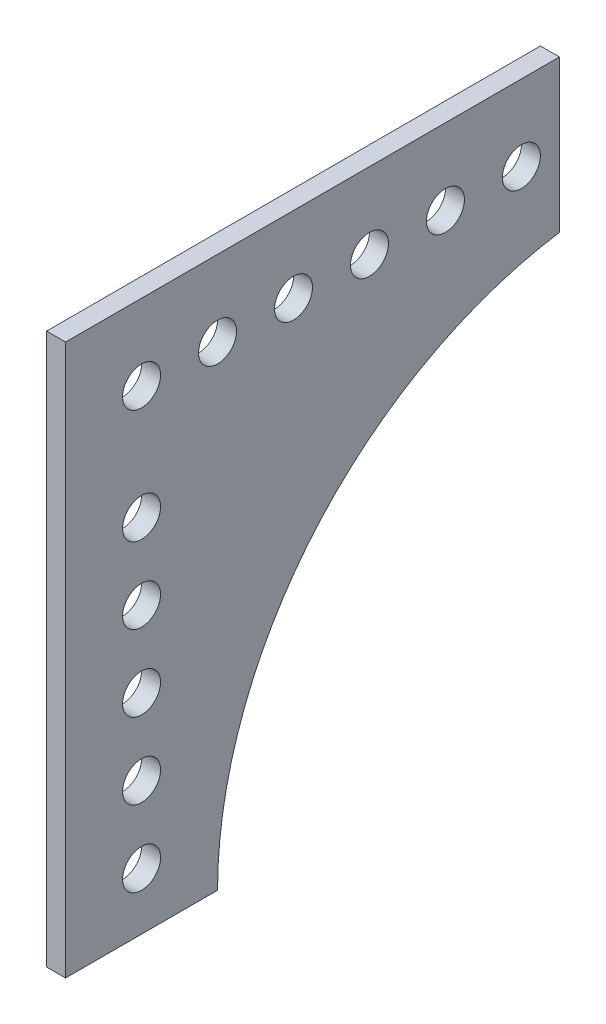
from build123d import *

# Parameters (mm, degrees)
SKETCH1_R           = 3.175
BOSS_EXTRUDE1_DEPTH = 3.175


with BuildPart() as part:
    # Sketch1 → Boss-Extrude1 (new body)
    with BuildSketch(Plane(origin=(146.399300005, 0, 0), x_dir=(0, 0, -1), z_dir=(1, 0, 0))):
        with BuildLine():
            Line((-622.240271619, 240.335090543), (-596.840271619, 240.335090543))
            ThreePointArc((-596.840271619, 240.335090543), (-580.597615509, 284.243171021), (-539.690271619, 307.010090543))
            Line((-539.690271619, 307.010090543), (-539.690271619, 332.410090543))
            Line((-539.690271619, 332.410090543), (-622.240271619, 332.410090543))
            Line((-622.240271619, 332.410090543), (-622.240271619, 240.335090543))
        make_face()
        with Locations((-609.540271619, 249.860090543)):
            Circle(SKETCH1_R, mode=Mode.SUBTRACT)
        with Locations((-609.540271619, 262.560090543)):
            Circle(SKETCH1_R, mode=Mode.SUBTRACT)
        with Locations((-609.540271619, 275.260090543)):
            Circle(SKETCH1_R, mode=Mode.SUBTRACT)
        with Locations((-609.540271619, 287.960090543)):
            Circle(SKETCH1_R, mode=Mode.SUBTRACT)
        with Locations((-609.540271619, 300.660090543)):
            Circle(SKETCH1_R, mode=Mode.SUBTRACT)
        with Locations((-546.040271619, 319.710090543)):
            Circle(SKETCH1_R, mode=Mode.SUBTRACT)
        with Locations((-558.740271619, 319.710090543)):
            Circle(SKETCH1_R, mode=Mode.SUBTRACT)
        with Locations((-609.540271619, 319.710090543)):
            Circle(SKETCH1_R, mode=Mode.SUBTRACT)
        with Locations((-596.840271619, 319.710090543)):
            Circle(SKETCH1_R, mode=Mode.SUBTRACT)
        with Locations((-584.140271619, 319.710090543)):
            Circle(SKETCH1_R, mode=Mode.SUBTRACT)
        with Locations((-571.440271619, 319.710090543)):
            Circle(SKETCH1_R, mode=Mode.SUBTRACT)
    extrude(amount=BOSS_EXTRUDE1_DEPTH)


solid = part.part
